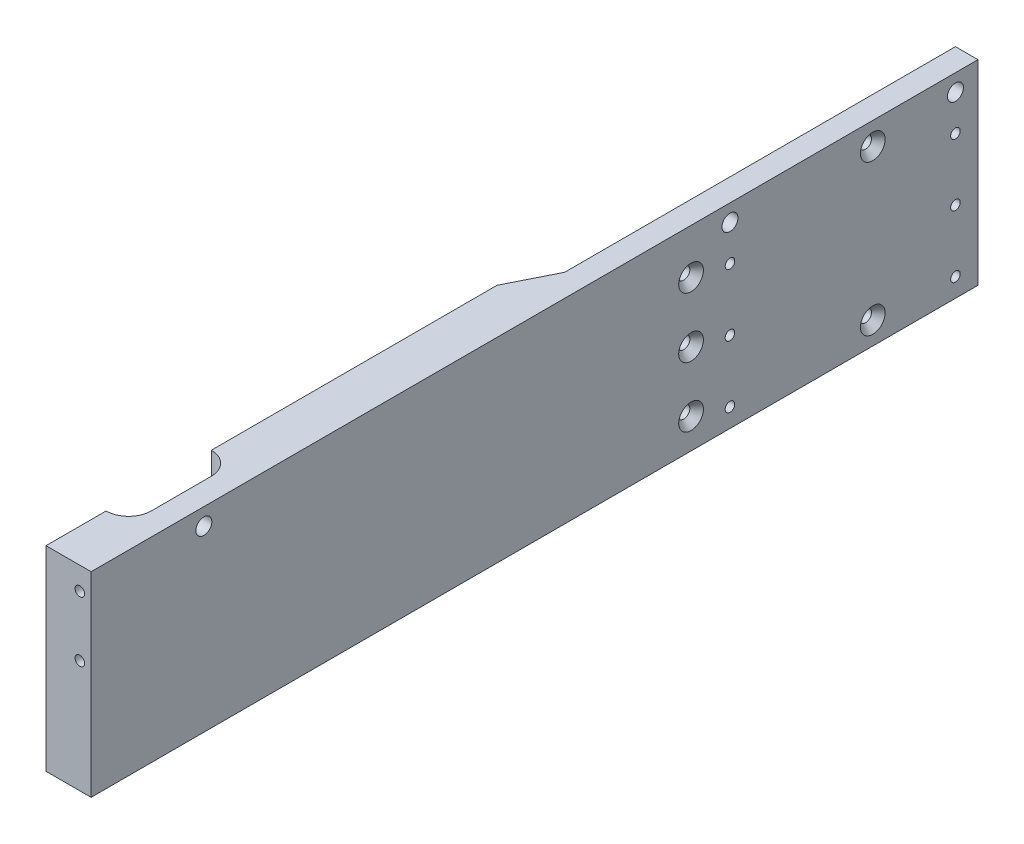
from build123d import *

# Parameters (mm, degrees)
SKETCH1_W                                          = 184.15
SKETCH1_H                                          = 82.55635
EXTRUDE1_DEPTH                                     = 9.525
F_10_32_TAPPED_HOLE1_D                             = 4.0386
EXTRUDE2_REACH                                     = 415.327
EXTRUDE2_DIRECTION_2_REACH                         = 415.327
F_1_4_CLEARANCE_HOLE1_D                            = 6.7564
SKETCH14_W                                         = 19.05
SKETCH14_H                                         = 82.55635
BOSS_EXTRUDE1_DEPTH                                = 190.5
F_10_32_TAPPED_HOLE2_D                             = 4.0386
F_10_32_TAPPED_HOLE2_DEPTH                         = 12.7
F_10_32_TAPPED_HOLE2_TIP                           = 1.213317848
F_10_32_TAPPED_HOLE3_D                             = 4.0386
F_10_32_TAPPED_HOLE3_DEPTH                         = 22.225
F_10_32_TAPPED_HOLE3_TIP                           = 1.213317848
CUT_EXTRUDE1_DEPTH                                 = 419.700356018
F_1_4_CLEARANCE_HOLE2_D                            = 6.7564
F_1_4_CLEARANCE_HOLE2_DEPTH                        = 31.75
F_1_4_CLEARANCE_HOLE2_TIP                          = 2.029827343
CSK_FOR_10_FLAT_HEAD_SOCKET_CAP_SCREW1_D           = 5.1054
CSK_FOR_10_FLAT_HEAD_SOCKET_CAP_SCREW1_CSINK_D     = 10.4394
CSK_FOR_10_FLAT_HEAD_SOCKET_CAP_SCREW1_CSINK_ANGLE = 82


with BuildPart() as part:
    # Sketch1 → Extrude1 (new body)
    with BuildSketch(Plane(origin=(91.948, 0, 0), x_dir=(0, 0, -1), z_dir=(1, 0, 0))):
        with Locations((307.975, 7.140575)):
            Rectangle(SKETCH1_W, SKETCH1_H)
    extrude(amount=-EXTRUDE1_DEPTH)

    # 10-32 Tapped Hole1 (through all)
    with Locations(Plane(origin=(91.948, 4.548158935, -246.767119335), x_dir=(0, 0, 1), z_dir=(1, 0, 0))):
        with Locations((-48.507880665, 4.548158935), (-143.757880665, 4.548158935), (-48.507880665, 30.741908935), (-48.507880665, -21.645591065), (-143.757880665, 30.741908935), (-143.757880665, -21.645591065)):
            Hole(F_10_32_TAPPED_HOLE1_D / 2)

    # Extrude2: up to this face of the body (flat: up to its plane)
    extrude2_end = Plane(part.part.faces().sort_by_distance((87.1855, 48.41875, -307.975))[0])
    # Sketch7 → Extrude2 (add, up to the picked face)
    with BuildSketch(Plane(origin=(0, 0, 0), x_dir=(1, 0, 0), z_dir=(0, 1, 0)), mode=Mode.PRIVATE) as extrude2_sk1:
        Polygon((82.423, 215.9), (82.423, 234.95), (72.898, 215.9), align=None)
    extrude2_tool1 = split(extrude(extrude2_sk1.sketch, amount=EXTRUDE2_REACH, mode=Mode.PRIVATE), bisect_by=extrude2_end, keep=Keep.BOTH, mode=Mode.PRIVATE)
    add(extrude2_tool1.solids().sort_by(Axis((79.248, 0, -222.25), (0, 1, 0)))[0])

    # Extrude2 direction 2: up to this face of the body (flat: up to its plane)
    extrude2_direction_2_end = Plane(part.part.faces().sort_by_distance((87.1855, -34.1376, -307.975))[0])
    # Sketch7 → Extrude2 direction 2 (add, up to the picked face)
    with BuildSketch(Plane(origin=(0, 0, 0), x_dir=(1, 0, 0), z_dir=(0, 1, 0)), mode=Mode.PRIVATE) as extrude2_direction_2_sk1:
        Polygon((82.423, 215.9), (82.423, 234.95), (72.898, 215.9), align=None)
    extrude2_direction_2_tool1 = split(extrude(extrude2_direction_2_sk1.sketch, amount=-EXTRUDE2_DIRECTION_2_REACH, mode=Mode.PRIVATE), bisect_by=extrude2_direction_2_end, keep=Keep.BOTH, mode=Mode.PRIVATE)
    add(extrude2_direction_2_tool1.solids().sort_by(Axis((79.248, 0, -222.25), (0, -1, 0)))[0])

    # 1_4 Clearance Hole1 (through all)
    with Locations(Plane(origin=(91.948, 0, 0), x_dir=(0, 0, -1), z_dir=(1, 0, 0))):
        with Locations((390.525, 41.275), (295.275, 41.275)):
            Hole(F_1_4_CLEARANCE_HOLE1_D / 2)

    # Sketch14 → Boss-Extrude1 (add)
    with BuildSketch(Plane.XY.offset(-215.9)):
        with Locations((82.423, 7.140575)):
            Rectangle(SKETCH14_W, SKETCH14_H)
    extrude(amount=BOSS_EXTRUDE1_DEPTH)

    # 10-32 Tapped Hole2
    with Locations(Plane.XZ.offset(34.1376)):
        with Locations((87.1855, -66.675), (87.1855, -149.225)):
            Hole(F_10_32_TAPPED_HOLE2_D / 2, depth=F_10_32_TAPPED_HOLE2_DEPTH)
            with Locations((0, 0, -(F_10_32_TAPPED_HOLE2_DEPTH + F_10_32_TAPPED_HOLE2_TIP / 2))):  # 118° drill point
                Cone(0, F_10_32_TAPPED_HOLE2_D / 2, F_10_32_TAPPED_HOLE2_TIP, mode=Mode.SUBTRACT)

    # 10-32 Tapped Hole3
    with Locations(Plane(origin=(-63.358653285, 0.218550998, -25.4), x_dir=(1, 0, 0), z_dir=(0, 0, 1))):
        with Locations((150.544153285, 13.268849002), (150.544153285, 38.668849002), (213.970315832, -57.631340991)):
            Hole(F_10_32_TAPPED_HOLE3_D / 2, depth=F_10_32_TAPPED_HOLE3_DEPTH)
            with Locations((0, 0, -(F_10_32_TAPPED_HOLE3_DEPTH + F_10_32_TAPPED_HOLE3_TIP / 2))):  # 118° drill point
                Cone(0, F_10_32_TAPPED_HOLE3_D / 2, F_10_32_TAPPED_HOLE3_TIP, mode=Mode.SUBTRACT)

    # Sketch15 → Cut-Extrude1 (cut, through all)
    with BuildSketch(Plane.XZ.offset(34.1376)):
        with BuildLine():
            Line((82.423, -85.725), (82.423, -60.325))
            ThreePointArc((82.423, -60.325), (79.633192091, -53.589807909), (72.898, -50.8))
            Line((72.898, -50.8), (72.898, -95.25))
            ThreePointArc((72.898, -95.25), (79.633192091, -92.460192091), (82.423, -85.725))
        make_face()
    extrude(amount=-CUT_EXTRUDE1_DEPTH, mode=Mode.SUBTRACT)

    # 1_4 Clearance Hole2
    with Locations(Plane(origin=(91.948, 0, 0), x_dir=(0, 0, -1), z_dir=(1, 0, 0))):
        with Locations((73.025, 41.275)):
            Hole(F_1_4_CLEARANCE_HOLE2_D / 2, depth=F_1_4_CLEARANCE_HOLE2_DEPTH)
            with Locations((0, 0, -(F_1_4_CLEARANCE_HOLE2_DEPTH + F_1_4_CLEARANCE_HOLE2_TIP / 2))):  # 118° drill point
                Cone(0, F_1_4_CLEARANCE_HOLE2_D / 2, F_1_4_CLEARANCE_HOLE2_TIP, mode=Mode.SUBTRACT)

    # CSK for _10 Flat Head Socket Cap Screw1 (through all)
    with Locations(Plane(origin=(91.948, 0, 0), x_dir=(0, 0, -1), z_dir=(1, 0, 0))):
        with Locations((355.6, 38.89375), (355.6, -24.6126), (362.957542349, 76.445174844), (278.8412, -21.4376), (278.8412, 3.9624), (278.8412, 29.3624)):
            CounterSinkHole(CSK_FOR_10_FLAT_HEAD_SOCKET_CAP_SCREW1_D / 2, CSK_FOR_10_FLAT_HEAD_SOCKET_CAP_SCREW1_CSINK_D / 2, counter_sink_angle=CSK_FOR_10_FLAT_HEAD_SOCKET_CAP_SCREW1_CSINK_ANGLE)


solid = part.part
